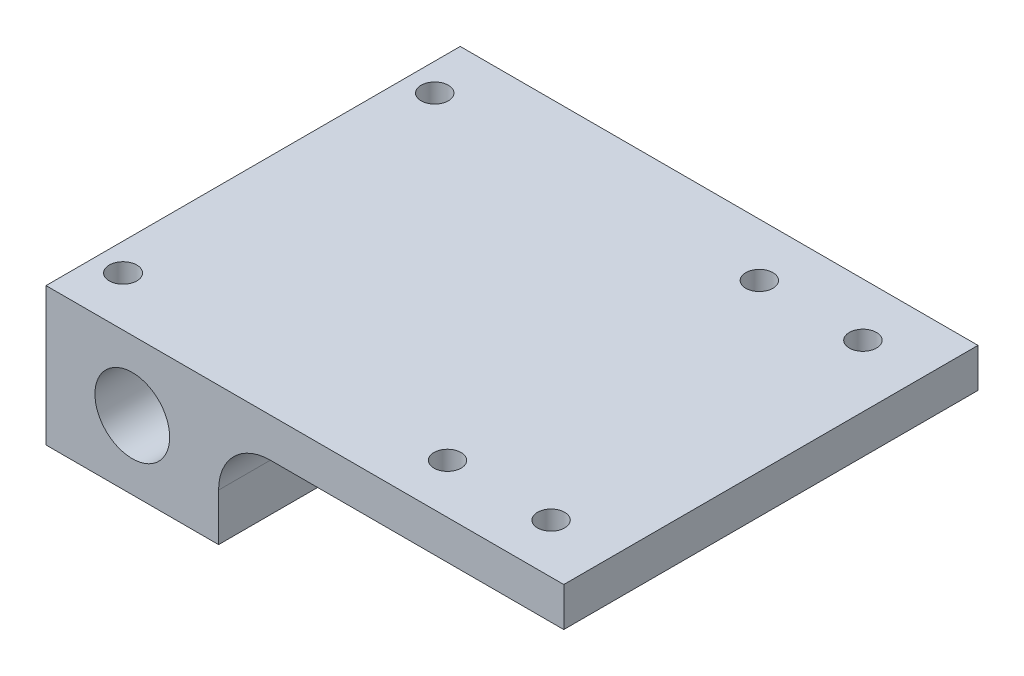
from build123d import *

# Parameters (mm, degrees)
BOSS_EXTRUDE1_DEPTH = 30.48
SKETCH2_R           = 2.75
CUT_EXTRUDE2_DEPTH  = 41.402
SKETCH3_R           = 1.016
SKETCH3_R_2         = 1
CUT_EXTRUDE3_DEPTH  = 41.402


with BuildPart() as part:
    # Sketch1 → Boss-Extrude1 (new body)
    with BuildSketch(Plane.XY):
        with BuildLine():
            Line((-27.124172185, 5.109437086), (10.975827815, 5.109437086))
            Line((10.975827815, 5.109437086), (10.975827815, 2.237218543))
            Line((10.975827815, 2.237218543), (-10.614172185, 2.237218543))
            ThreePointArc((-10.614172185, 2.237218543), (-13.308249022, 1.121295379), (-14.424172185, -1.572781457))
            Line((-14.424172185, -1.572781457), (-14.424172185, -5.050562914))
            Line((-14.424172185, -5.050562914), (-27.124172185, -5.050562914))
            Line((-27.124172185, -5.050562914), (-27.124172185, 5.109437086))
        make_face()
    extrude(amount=BOSS_EXTRUDE1_DEPTH)

    # Sketch2 → Cut-Extrude2 (cut)
    with BuildSketch(Plane.XY.offset(30.48)):
        with Locations((-20.774172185, 0)):
            Circle(SKETCH2_R)
    extrude(amount=-CUT_EXTRUDE2_DEPTH, mode=Mode.SUBTRACT)

    # Sketch3 → Cut-Extrude3 (cut)
    with BuildSketch(Plane(origin=(0, 5.109437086, 0), x_dir=(1, 0, 0), z_dir=(0, 1, 0))):
        with Locations(Location((-25.092172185, -26.84237911, 0), (0, 0, 270))):
            Circle(SKETCH3_R)
        with Locations(Location((-25.092172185, -3.909088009, 0), (0, 0, 270))):
            Circle(SKETCH3_R_2)
        with Locations(Location((-1.216172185, -26.84237911, 0), (0, 0, 270))):
            Circle(SKETCH3_R_2)
        with Locations(Location((-1.204172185, -3.909088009, 0), (0, 0, 270))):
            Circle(SKETCH3_R_2)
        with Locations(Location((6.415827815, -3.909088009, 0), (0, 0, 270))):
            Circle(SKETCH3_R_2)
        with Locations(Location((6.403827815, -26.84237911, 0), (0, 0, 270))):
            Circle(SKETCH3_R_2)
    extrude(amount=-CUT_EXTRUDE3_DEPTH, mode=Mode.SUBTRACT)


solid = part.part
